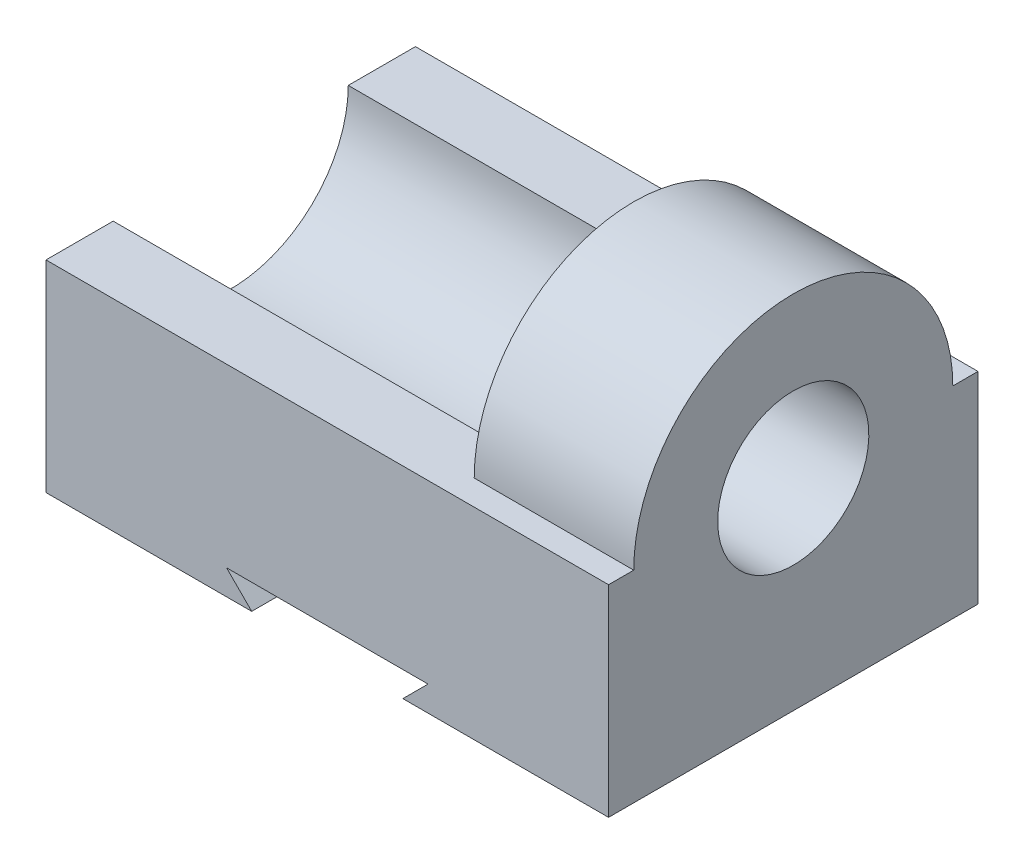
from build123d import *

# Parameters (mm, degrees)
EXTRUDE_1_DEPTH     = 22
EXTRUDE_2_DEPTH     = 19
SKETCH_3_R          = 9
CUT_EXTRUDE_1_DEPTH = 19
SKETCH_4_R          = 14
CUT_EXTRUDE_2_DEPTH = 48


with BuildPart() as part:
    # Sketch 1 → Extrude 1 (new, symmetric)
    with BuildSketch(Plane.XY):
        Polygon((0, 0), (24.5, 0), (21.5, 3), (45.5, 3), (42.5, 0), (67, 0), (67, 24), (0, 24), align=None)
    extrude(amount=EXTRUDE_1_DEPTH, both=True)

    # Sketch 2 → Extrude 2 (add)
    with BuildSketch(Plane(origin=(67, 0, 0), x_dir=(0, 0, -1), z_dir=(1, 0, 0))):
        with BuildLine():
            Line((19, 24), (-19, 24))
            ThreePointArc((-19, 24), (0, 43), (19, 24))
        make_face()
    extrude(amount=-EXTRUDE_2_DEPTH)

    # Sketch 3 → Cut-Extrude 1 (cut)
    with BuildSketch(Plane(origin=(67, 0, 0), x_dir=(0, 0, -1), z_dir=(1, 0, 0))):
        with Locations(Location((0, 24, 0), (0, 0, 90))):
            Circle(SKETCH_3_R)
    extrude(amount=-CUT_EXTRUDE_1_DEPTH, mode=Mode.SUBTRACT)

    # Sketch 4 → Cut-Extrude 2 (cut)
    with BuildSketch(Plane.ZY):
        with Locations((0, 24)):
            Circle(SKETCH_4_R)
    extrude(amount=-CUT_EXTRUDE_2_DEPTH, mode=Mode.SUBTRACT)


solid = part.part
